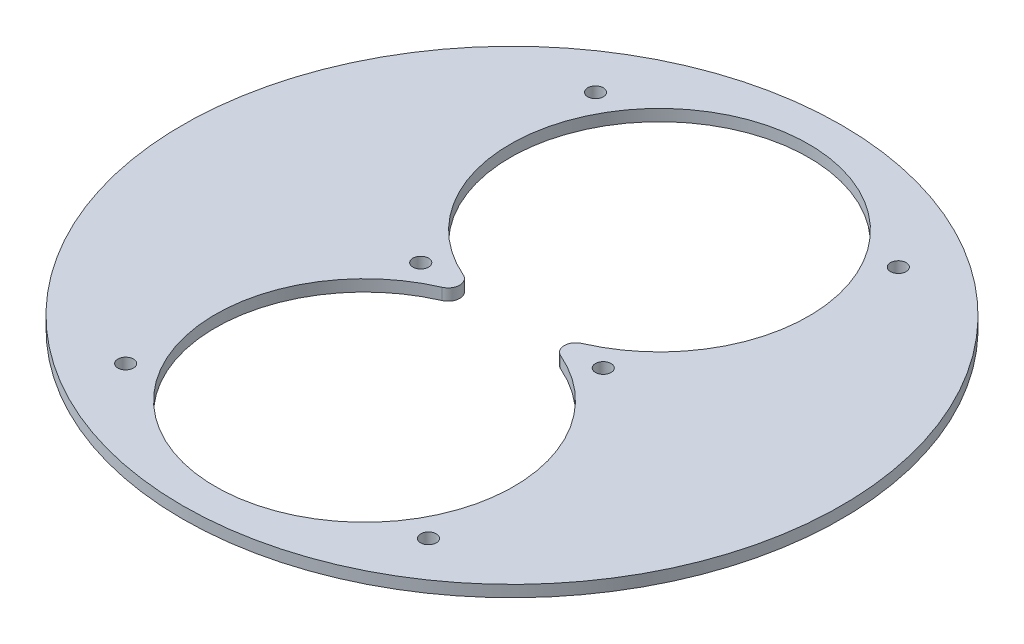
ISO-10303-21;
HEADER;
FILE_DESCRIPTION(('STEP AP214'),'2;1');
FILE_NAME('part.step','',(''),(''),'','','');
FILE_SCHEMA(('AUTOMOTIVE_DESIGN { 1 0 10303 214 1 1 1 1 }'));
ENDSEC;
DATA;
#1=APPLICATION_CONTEXT('core data for automotive mechanical design processes');
#2=APPLICATION_PROTOCOL_DEFINITION('international standard','automotive_design',2000,#1);
#3=PRODUCT_CONTEXT('',#1,'mechanical');
#4=PRODUCT('Part','Part','',(#3));
#5=PRODUCT_RELATED_PRODUCT_CATEGORY('part','',(#4));
#6=PRODUCT_DEFINITION_FORMATION('','',#4);
#7=PRODUCT_DEFINITION_CONTEXT('part definition',#1,'design');
#8=PRODUCT_DEFINITION('design','',#6,#7);
#9=PRODUCT_DEFINITION_SHAPE('','',#8);
#10=(LENGTH_UNIT() NAMED_UNIT(*) SI_UNIT(.MILLI.,.METRE.));
#11=(NAMED_UNIT(*) PLANE_ANGLE_UNIT() SI_UNIT($,.RADIAN.));
#12=(NAMED_UNIT(*) SI_UNIT($,.STERADIAN.) SOLID_ANGLE_UNIT());
#13=UNCERTAINTY_MEASURE_WITH_UNIT(LENGTH_MEASURE(1.E-05),#10,'distance_accuracy_value','');
#14=(GEOMETRIC_REPRESENTATION_CONTEXT(3) GLOBAL_UNCERTAINTY_ASSIGNED_CONTEXT((#13)) GLOBAL_UNIT_ASSIGNED_CONTEXT((#10,
#11,#12)) REPRESENTATION_CONTEXT('',''));
#15=CARTESIAN_POINT('',(0.,0.,0.));
#16=DIRECTION('',(0.,0.,1.));
#17=DIRECTION('',(1.,0.,0.));
#18=AXIS2_PLACEMENT_3D('',#15,#16,#17);
#19=CARTESIAN_POINT('',(0.,0.,0.));
#20=DIRECTION('',(0.,1.,0.));
#21=DIRECTION('',(0.,0.,1.));
#22=AXIS2_PLACEMENT_3D('',#19,#20,#21);
#23=PLANE('',#22);
#24=CARTESIAN_POINT('',(25.0577458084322,0.,0.));
#25=DIRECTION('',(0.,-1.,0.));
#26=DIRECTION('',(0.,0.,-1.));
#27=AXIS2_PLACEMENT_3D('',#24,#25,#26);
#28=CIRCLE('',#27,2.14999999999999);
#29=CARTESIAN_POINT('',(25.0577458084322,0.,-2.15000000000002));
#30=VERTEX_POINT('',#29);
#31=EDGE_CURVE('E163',#30,#30,#28,.T.);
#32=ORIENTED_EDGE('',*,*,#31,.F.);
#33=EDGE_LOOP('',(#32));
#34=FACE_BOUND('',#33,.T.);
#35=CARTESIAN_POINT('',(-25.0577458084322,0.,0.));
#36=DIRECTION('',(0.,-1.,0.));
#37=DIRECTION('',(0.,0.,-1.));
#38=AXIS2_PLACEMENT_3D('',#35,#36,#37);
#39=CIRCLE('',#38,2.14999999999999);
#40=CARTESIAN_POINT('',(-25.0577458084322,0.,-2.15));
#41=VERTEX_POINT('',#40);
#42=EDGE_CURVE('E150',#41,#41,#39,.T.);
#43=ORIENTED_EDGE('',*,*,#42,.F.);
#44=EDGE_LOOP('',(#43));
#45=FACE_BOUND('',#44,.T.);
#46=CARTESIAN_POINT('',(-41.5692193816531,0.,64.4999999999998));
#47=DIRECTION('',(0.,-1.,0.));
#48=DIRECTION('',(0.,0.,-1.));
#49=AXIS2_PLACEMENT_3D('',#46,#47,#48);
#50=CIRCLE('',#49,2.14999999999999);
#51=CARTESIAN_POINT('',(-41.5692193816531,0.,62.3499999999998));
#52=VERTEX_POINT('',#51);
#53=EDGE_CURVE('E146',#52,#52,#50,.T.);
#54=ORIENTED_EDGE('',*,*,#53,.F.);
#55=EDGE_LOOP('',(#54));
#56=FACE_BOUND('',#55,.T.);
#57=CARTESIAN_POINT('',(41.5692193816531,0.,-64.5));
#58=DIRECTION('',(0.,-1.,0.));
#59=DIRECTION('',(0.,0.,-1.));
#60=AXIS2_PLACEMENT_3D('',#57,#58,#59);
#61=CIRCLE('',#60,2.14999999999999);
#62=CARTESIAN_POINT('',(41.5692193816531,0.,-66.65));
#63=VERTEX_POINT('',#62);
#64=EDGE_CURVE('E173',#63,#63,#61,.T.);
#65=ORIENTED_EDGE('',*,*,#64,.F.);
#66=EDGE_LOOP('',(#65));
#67=FACE_BOUND('',#66,.T.);
#68=CARTESIAN_POINT('',(-41.5692193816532,0.,-64.5));
#69=DIRECTION('',(0.,-1.,0.));
#70=DIRECTION('',(0.,0.,-1.));
#71=AXIS2_PLACEMENT_3D('',#68,#69,#70);
#72=CIRCLE('',#71,2.14999999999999);
#73=CARTESIAN_POINT('',(-41.5692193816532,0.,-66.65));
#74=VERTEX_POINT('',#73);
#75=EDGE_CURVE('E181',#74,#74,#72,.T.);
#76=ORIENTED_EDGE('',*,*,#75,.F.);
#77=EDGE_LOOP('',(#76));
#78=FACE_BOUND('',#77,.T.);
#79=CARTESIAN_POINT('',(0.,0.,0.));
#80=DIRECTION('',(0.,1.,0.));
#81=DIRECTION('',(0.,0.,1.));
#82=AXIS2_PLACEMENT_3D('',#79,#80,#81);
#83=CIRCLE('',#82,90.4875);
#84=CARTESIAN_POINT('',(0.,0.,90.4875));
#85=VERTEX_POINT('',#84);
#86=EDGE_CURVE('E55',#85,#85,#83,.T.);
#87=ORIENTED_EDGE('',*,*,#86,.F.);
#88=EDGE_LOOP('',(#87));
#89=FACE_BOUND('',#88,.T.);
#90=CARTESIAN_POINT('',(17.5336121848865,0.,0.));
#91=DIRECTION('',(0.,-1.,0.));
#92=DIRECTION('',(0.,0.,1.));
#93=AXIS2_PLACEMENT_3D('',#90,#91,#92);
#94=CIRCLE('',#93,3.175);
#95=CARTESIAN_POINT('',(16.2722012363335,0.,2.91366906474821));
#96=VERTEX_POINT('',#95);
#97=CARTESIAN_POINT('',(16.2722012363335,0.,-2.91366906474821));
#98=VERTEX_POINT('',#97);
#99=EDGE_CURVE('E71',#96,#98,#94,.T.);
#100=ORIENTED_EDGE('',*,*,#99,.T.);
#101=CARTESIAN_POINT('',(0.,0.,-40.5));
#102=DIRECTION('',(0.,1.,0.));
#103=DIRECTION('',(0.,0.,1.));
#104=AXIS2_PLACEMENT_3D('',#101,#102,#103);
#105=CIRCLE('',#104,40.9575);
#106=CARTESIAN_POINT('',(-16.2722012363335,0.,-2.91366906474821));
#107=VERTEX_POINT('',#106);
#108=EDGE_CURVE('E105',#98,#107,#105,.T.);
#109=ORIENTED_EDGE('',*,*,#108,.T.);
#110=CARTESIAN_POINT('',(-17.5336121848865,0.,0.));
#111=DIRECTION('',(0.,-1.,0.));
#112=DIRECTION('',(0.,0.,1.));
#113=AXIS2_PLACEMENT_3D('',#110,#111,#112);
#114=CIRCLE('',#113,3.175);
#115=CARTESIAN_POINT('',(-16.2722012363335,0.,2.91366906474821));
#116=VERTEX_POINT('',#115);
#117=EDGE_CURVE('E126',#107,#116,#114,.T.);
#118=ORIENTED_EDGE('',*,*,#117,.T.);
#119=CARTESIAN_POINT('',(0.,0.,40.5));
#120=DIRECTION('',(0.,1.,0.));
#121=DIRECTION('',(0.,0.,1.));
#122=AXIS2_PLACEMENT_3D('',#119,#120,#121);
#123=CIRCLE('',#122,40.9575);
#124=EDGE_CURVE('E99',#116,#96,#123,.T.);
#125=ORIENTED_EDGE('',*,*,#124,.T.);
#126=EDGE_LOOP('',(#100,#109,#118,#125));
#127=FACE_BOUND('',#126,.T.);
#128=CARTESIAN_POINT('',(41.5692193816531,0.,64.4999999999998));
#129=DIRECTION('',(0.,-1.,0.));
#130=DIRECTION('',(0.,0.,-1.));
#131=AXIS2_PLACEMENT_3D('',#128,#129,#130);
#132=CIRCLE('',#131,2.14999999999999);
#133=CARTESIAN_POINT('',(41.5692193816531,0.,62.3499999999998));
#134=VERTEX_POINT('',#133);
#135=EDGE_CURVE('E145',#134,#134,#132,.T.);
#136=ORIENTED_EDGE('',*,*,#135,.F.);
#137=EDGE_LOOP('',(#136));
#138=FACE_BOUND('',#137,.T.);
#139=ADVANCED_FACE('F45',(#34,#45,#56,#67,#78,#89,#127,#138),#23,.F.);
#140=CARTESIAN_POINT('',(0.,3.175,0.));
#141=DIRECTION('',(0.,1.,0.));
#142=DIRECTION('',(0.,0.,1.));
#143=AXIS2_PLACEMENT_3D('',#140,#141,#142);
#144=PLANE('',#143);
#145=CARTESIAN_POINT('',(25.0577458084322,3.175,0.));
#146=DIRECTION('',(0.,1.,0.));
#147=DIRECTION('',(0.,0.,1.));
#148=AXIS2_PLACEMENT_3D('',#145,#146,#147);
#149=CIRCLE('',#148,2.14999999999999);
#150=CARTESIAN_POINT('',(25.0577458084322,3.175,2.14999999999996));
#151=VERTEX_POINT('',#150);
#152=EDGE_CURVE('E49',#151,#151,#149,.T.);
#153=ORIENTED_EDGE('',*,*,#152,.F.);
#154=EDGE_LOOP('',(#153));
#155=FACE_BOUND('',#154,.T.);
#156=CARTESIAN_POINT('',(-25.0577458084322,3.175,0.));
#157=DIRECTION('',(0.,1.,0.));
#158=DIRECTION('',(0.,0.,1.));
#159=AXIS2_PLACEMENT_3D('',#156,#157,#158);
#160=CIRCLE('',#159,2.14999999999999);
#161=CARTESIAN_POINT('',(-25.0577458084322,3.175,2.14999999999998));
#162=VERTEX_POINT('',#161);
#163=EDGE_CURVE('E147',#162,#162,#160,.T.);
#164=ORIENTED_EDGE('',*,*,#163,.F.);
#165=EDGE_LOOP('',(#164));
#166=FACE_BOUND('',#165,.T.);
#167=CARTESIAN_POINT('',(-41.5692193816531,3.175,64.4999999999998));
#168=DIRECTION('',(0.,1.,0.));
#169=DIRECTION('',(0.,0.,1.));
#170=AXIS2_PLACEMENT_3D('',#167,#168,#169);
#171=CIRCLE('',#170,2.14999999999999);
#172=CARTESIAN_POINT('',(-41.5692193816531,3.175,66.6499999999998));
#173=VERTEX_POINT('',#172);
#174=EDGE_CURVE('E142',#173,#173,#171,.T.);
#175=ORIENTED_EDGE('',*,*,#174,.F.);
#176=EDGE_LOOP('',(#175));
#177=FACE_BOUND('',#176,.T.);
#178=CARTESIAN_POINT('',(41.5692193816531,3.175,64.4999999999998));
#179=DIRECTION('',(0.,1.,0.));
#180=DIRECTION('',(0.,0.,1.));
#181=AXIS2_PLACEMENT_3D('',#178,#179,#180);
#182=CIRCLE('',#181,2.14999999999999);
#183=CARTESIAN_POINT('',(41.5692193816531,3.175,66.6499999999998));
#184=VERTEX_POINT('',#183);
#185=EDGE_CURVE('E169',#184,#184,#182,.T.);
#186=ORIENTED_EDGE('',*,*,#185,.F.);
#187=EDGE_LOOP('',(#186));
#188=FACE_BOUND('',#187,.T.);
#189=CARTESIAN_POINT('',(41.5692193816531,3.175,-64.5));
#190=DIRECTION('',(0.,1.,0.));
#191=DIRECTION('',(0.,0.,1.));
#192=AXIS2_PLACEMENT_3D('',#189,#190,#191);
#193=CIRCLE('',#192,2.14999999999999);
#194=CARTESIAN_POINT('',(41.5692193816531,3.175,-62.3500000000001));
#195=VERTEX_POINT('',#194);
#196=EDGE_CURVE('E177',#195,#195,#193,.T.);
#197=ORIENTED_EDGE('',*,*,#196,.F.);
#198=EDGE_LOOP('',(#197));
#199=FACE_BOUND('',#198,.T.);
#200=CARTESIAN_POINT('',(-41.5692193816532,3.175,-64.5));
#201=DIRECTION('',(0.,1.,0.));
#202=DIRECTION('',(0.,0.,1.));
#203=AXIS2_PLACEMENT_3D('',#200,#201,#202);
#204=CIRCLE('',#203,2.14999999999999);
#205=CARTESIAN_POINT('',(-41.5692193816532,3.175,-62.3500000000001));
#206=VERTEX_POINT('',#205);
#207=EDGE_CURVE('E123',#206,#206,#204,.T.);
#208=ORIENTED_EDGE('',*,*,#207,.F.);
#209=EDGE_LOOP('',(#208));
#210=FACE_BOUND('',#209,.T.);
#211=CARTESIAN_POINT('',(0.,3.175,0.));
#212=DIRECTION('',(0.,1.,0.));
#213=DIRECTION('',(0.,0.,1.));
#214=AXIS2_PLACEMENT_3D('',#211,#212,#213);
#215=CIRCLE('',#214,90.4875);
#216=CARTESIAN_POINT('',(0.,3.175,90.4875));
#217=VERTEX_POINT('',#216);
#218=EDGE_CURVE('E11',#217,#217,#215,.T.);
#219=ORIENTED_EDGE('',*,*,#218,.T.);
#220=EDGE_LOOP('',(#219));
#221=FACE_BOUND('',#220,.T.);
#222=CARTESIAN_POINT('',(0.,3.175,-40.5));
#223=DIRECTION('',(0.,1.,0.));
#224=DIRECTION('',(0.,0.,1.));
#225=AXIS2_PLACEMENT_3D('',#222,#223,#224);
#226=CIRCLE('',#225,40.9575);
#227=CARTESIAN_POINT('',(16.2722012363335,3.175,-2.91366906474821));
#228=VERTEX_POINT('',#227);
#229=CARTESIAN_POINT('',(-16.2722012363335,3.175,-2.91366906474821));
#230=VERTEX_POINT('',#229);
#231=EDGE_CURVE('E98',#228,#230,#226,.T.);
#232=ORIENTED_EDGE('',*,*,#231,.F.);
#233=CARTESIAN_POINT('',(17.5336121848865,3.175,0.));
#234=DIRECTION('',(0.,-1.,0.));
#235=DIRECTION('',(0.,0.,1.));
#236=AXIS2_PLACEMENT_3D('',#233,#234,#235);
#237=CIRCLE('',#236,3.175);
#238=CARTESIAN_POINT('',(16.2722012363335,3.175,2.91366906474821));
#239=VERTEX_POINT('',#238);
#240=EDGE_CURVE('E89',#239,#228,#237,.T.);
#241=ORIENTED_EDGE('',*,*,#240,.F.);
#242=CARTESIAN_POINT('',(0.,3.175,40.5));
#243=DIRECTION('',(0.,1.,0.));
#244=DIRECTION('',(0.,0.,1.));
#245=AXIS2_PLACEMENT_3D('',#242,#243,#244);
#246=CIRCLE('',#245,40.9575);
#247=CARTESIAN_POINT('',(-16.2722012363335,3.175,2.91366906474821));
#248=VERTEX_POINT('',#247);
#249=EDGE_CURVE('E115',#248,#239,#246,.T.);
#250=ORIENTED_EDGE('',*,*,#249,.F.);
#251=CARTESIAN_POINT('',(-17.5336121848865,3.175,0.));
#252=DIRECTION('',(0.,-1.,0.));
#253=DIRECTION('',(0.,0.,1.));
#254=AXIS2_PLACEMENT_3D('',#251,#252,#253);
#255=CIRCLE('',#254,3.175);
#256=EDGE_CURVE('E111',#230,#248,#255,.T.);
#257=ORIENTED_EDGE('',*,*,#256,.F.);
#258=EDGE_LOOP('',(#232,#241,#250,#257));
#259=FACE_BOUND('',#258,.T.);
#260=ADVANCED_FACE('F110',(#155,#166,#177,#188,#199,#210,#221,#259),#144,.T.);
#261=CARTESIAN_POINT('',(0.,3.175,0.));
#262=DIRECTION('',(0.,-1.,0.));
#263=DIRECTION('',(0.,0.,-1.));
#264=AXIS2_PLACEMENT_3D('',#261,#262,#263);
#265=CYLINDRICAL_SURFACE('',#264,90.4875);
#266=ORIENTED_EDGE('',*,*,#218,.F.);
#267=EDGE_LOOP('',(#266));
#268=FACE_BOUND('',#267,.T.);
#269=ORIENTED_EDGE('',*,*,#86,.T.);
#270=EDGE_LOOP('',(#269));
#271=FACE_BOUND('',#270,.T.);
#272=ADVANCED_FACE('F47',(#268,#271),#265,.T.);
#273=CARTESIAN_POINT('',(17.5336121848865,3.175,0.));
#274=DIRECTION('',(0.,-1.,0.));
#275=DIRECTION('',(0.,0.,-1.));
#276=AXIS2_PLACEMENT_3D('',#273,#274,#275);
#277=CYLINDRICAL_SURFACE('',#276,3.175);
#278=ORIENTED_EDGE('',*,*,#99,.F.);
#279=DIRECTION('',(0.,-1.,0.));
#280=VECTOR('',#279,1.);
#281=CARTESIAN_POINT('',(16.2722012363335,3.175,2.91366906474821));
#282=LINE('',#281,#280);
#283=EDGE_CURVE('E93',#239,#96,#282,.T.);
#284=ORIENTED_EDGE('',*,*,#283,.F.);
#285=ORIENTED_EDGE('',*,*,#240,.T.);
#286=DIRECTION('',(0.,-1.,0.));
#287=VECTOR('',#286,1.);
#288=CARTESIAN_POINT('',(16.2722012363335,3.175,-2.91366906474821));
#289=LINE('',#288,#287);
#290=EDGE_CURVE('E92',#228,#98,#289,.T.);
#291=ORIENTED_EDGE('',*,*,#290,.T.);
#292=EDGE_LOOP('',(#278,#284,#285,#291));
#293=FACE_BOUND('',#292,.T.);
#294=ADVANCED_FACE('F91',(#293),#277,.T.);
#295=CARTESIAN_POINT('',(0.,3.175,-40.5));
#296=DIRECTION('',(0.,-1.,0.));
#297=DIRECTION('',(0.,0.,-1.));
#298=AXIS2_PLACEMENT_3D('',#295,#296,#297);
#299=CYLINDRICAL_SURFACE('',#298,40.9575);
#300=ORIENTED_EDGE('',*,*,#108,.F.);
#301=ORIENTED_EDGE('',*,*,#290,.F.);
#302=ORIENTED_EDGE('',*,*,#231,.T.);
#303=DIRECTION('',(0.,-1.,0.));
#304=VECTOR('',#303,1.);
#305=CARTESIAN_POINT('',(-16.2722012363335,3.175,-2.91366906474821));
#306=LINE('',#305,#304);
#307=EDGE_CURVE('E107',#230,#107,#306,.T.);
#308=ORIENTED_EDGE('',*,*,#307,.T.);
#309=EDGE_LOOP('',(#300,#301,#302,#308));
#310=FACE_BOUND('',#309,.T.);
#311=ADVANCED_FACE('F102',(#310),#299,.F.);
#312=CARTESIAN_POINT('',(-17.5336121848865,3.175,0.));
#313=DIRECTION('',(0.,-1.,0.));
#314=DIRECTION('',(0.,0.,-1.));
#315=AXIS2_PLACEMENT_3D('',#312,#313,#314);
#316=CYLINDRICAL_SURFACE('',#315,3.175);
#317=ORIENTED_EDGE('',*,*,#117,.F.);
#318=ORIENTED_EDGE('',*,*,#307,.F.);
#319=ORIENTED_EDGE('',*,*,#256,.T.);
#320=DIRECTION('',(0.,-1.,0.));
#321=VECTOR('',#320,1.);
#322=CARTESIAN_POINT('',(-16.2722012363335,3.175,2.91366906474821));
#323=LINE('',#322,#321);
#324=EDGE_CURVE('E63',#248,#116,#323,.T.);
#325=ORIENTED_EDGE('',*,*,#324,.T.);
#326=EDGE_LOOP('',(#317,#318,#319,#325));
#327=FACE_BOUND('',#326,.T.);
#328=ADVANCED_FACE('F229',(#327),#316,.T.);
#329=CARTESIAN_POINT('',(0.,3.175,40.5));
#330=DIRECTION('',(0.,-1.,0.));
#331=DIRECTION('',(0.,0.,-1.));
#332=AXIS2_PLACEMENT_3D('',#329,#330,#331);
#333=CYLINDRICAL_SURFACE('',#332,40.9575);
#334=ORIENTED_EDGE('',*,*,#124,.F.);
#335=ORIENTED_EDGE('',*,*,#324,.F.);
#336=ORIENTED_EDGE('',*,*,#249,.T.);
#337=ORIENTED_EDGE('',*,*,#283,.T.);
#338=EDGE_LOOP('',(#334,#335,#336,#337));
#339=FACE_BOUND('',#338,.T.);
#340=ADVANCED_FACE('F226',(#339),#333,.F.);
#341=CARTESIAN_POINT('',(-41.5692193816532,0.,-64.5));
#342=DIRECTION('',(0.,-1.,0.));
#343=DIRECTION('',(0.,0.,-1.));
#344=AXIS2_PLACEMENT_3D('',#341,#342,#343);
#345=CYLINDRICAL_SURFACE('',#344,2.14999999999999);
#346=ORIENTED_EDGE('',*,*,#207,.T.);
#347=EDGE_LOOP('',(#346));
#348=FACE_BOUND('',#347,.T.);
#349=ORIENTED_EDGE('',*,*,#75,.T.);
#350=EDGE_LOOP('',(#349));
#351=FACE_BOUND('',#350,.T.);
#352=ADVANCED_FACE('F188',(#348,#351),#345,.F.);
#353=CARTESIAN_POINT('',(41.5692193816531,0.,-64.5));
#354=DIRECTION('',(0.,-1.,0.));
#355=DIRECTION('',(0.,0.,-1.));
#356=AXIS2_PLACEMENT_3D('',#353,#354,#355);
#357=CYLINDRICAL_SURFACE('',#356,2.14999999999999);
#358=ORIENTED_EDGE('',*,*,#196,.T.);
#359=EDGE_LOOP('',(#358));
#360=FACE_BOUND('',#359,.T.);
#361=ORIENTED_EDGE('',*,*,#64,.T.);
#362=EDGE_LOOP('',(#361));
#363=FACE_BOUND('',#362,.T.);
#364=ADVANCED_FACE('F210',(#360,#363),#357,.F.);
#365=CARTESIAN_POINT('',(41.5692193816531,0.,64.4999999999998));
#366=DIRECTION('',(0.,-1.,0.));
#367=DIRECTION('',(0.,0.,-1.));
#368=AXIS2_PLACEMENT_3D('',#365,#366,#367);
#369=CYLINDRICAL_SURFACE('',#368,2.14999999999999);
#370=ORIENTED_EDGE('',*,*,#185,.T.);
#371=EDGE_LOOP('',(#370));
#372=FACE_BOUND('',#371,.T.);
#373=ORIENTED_EDGE('',*,*,#135,.T.);
#374=EDGE_LOOP('',(#373));
#375=FACE_BOUND('',#374,.T.);
#376=ADVANCED_FACE('F207',(#372,#375),#369,.F.);
#377=CARTESIAN_POINT('',(-41.5692193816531,0.,64.4999999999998));
#378=DIRECTION('',(0.,-1.,0.));
#379=DIRECTION('',(0.,0.,-1.));
#380=AXIS2_PLACEMENT_3D('',#377,#378,#379);
#381=CYLINDRICAL_SURFACE('',#380,2.14999999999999);
#382=ORIENTED_EDGE('',*,*,#174,.T.);
#383=EDGE_LOOP('',(#382));
#384=FACE_BOUND('',#383,.T.);
#385=ORIENTED_EDGE('',*,*,#53,.T.);
#386=EDGE_LOOP('',(#385));
#387=FACE_BOUND('',#386,.T.);
#388=ADVANCED_FACE('F209',(#384,#387),#381,.F.);
#389=CARTESIAN_POINT('',(-25.0577458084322,0.,0.));
#390=DIRECTION('',(0.,-1.,0.));
#391=DIRECTION('',(0.,0.,-1.));
#392=AXIS2_PLACEMENT_3D('',#389,#390,#391);
#393=CYLINDRICAL_SURFACE('',#392,2.14999999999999);
#394=ORIENTED_EDGE('',*,*,#163,.T.);
#395=EDGE_LOOP('',(#394));
#396=FACE_BOUND('',#395,.T.);
#397=ORIENTED_EDGE('',*,*,#42,.T.);
#398=EDGE_LOOP('',(#397));
#399=FACE_BOUND('',#398,.T.);
#400=ADVANCED_FACE('F217',(#396,#399),#393,.F.);
#401=CARTESIAN_POINT('',(25.0577458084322,0.,0.));
#402=DIRECTION('',(0.,-1.,0.));
#403=DIRECTION('',(0.,0.,-1.));
#404=AXIS2_PLACEMENT_3D('',#401,#402,#403);
#405=CYLINDRICAL_SURFACE('',#404,2.14999999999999);
#406=ORIENTED_EDGE('',*,*,#152,.T.);
#407=EDGE_LOOP('',(#406));
#408=FACE_BOUND('',#407,.T.);
#409=ORIENTED_EDGE('',*,*,#31,.T.);
#410=EDGE_LOOP('',(#409));
#411=FACE_BOUND('',#410,.T.);
#412=ADVANCED_FACE('F294',(#408,#411),#405,.F.);
#413=CLOSED_SHELL('',(#139,#260,#272,#294,#311,#328,#340,#352,#364,#376,#388,#400,#412));
#414=MANIFOLD_SOLID_BREP('B2',#413);
#415=ADVANCED_BREP_SHAPE_REPRESENTATION('',(#18,#414),#14);
#416=SHAPE_DEFINITION_REPRESENTATION(#9,#415);
ENDSEC;
END-ISO-10303-21;
